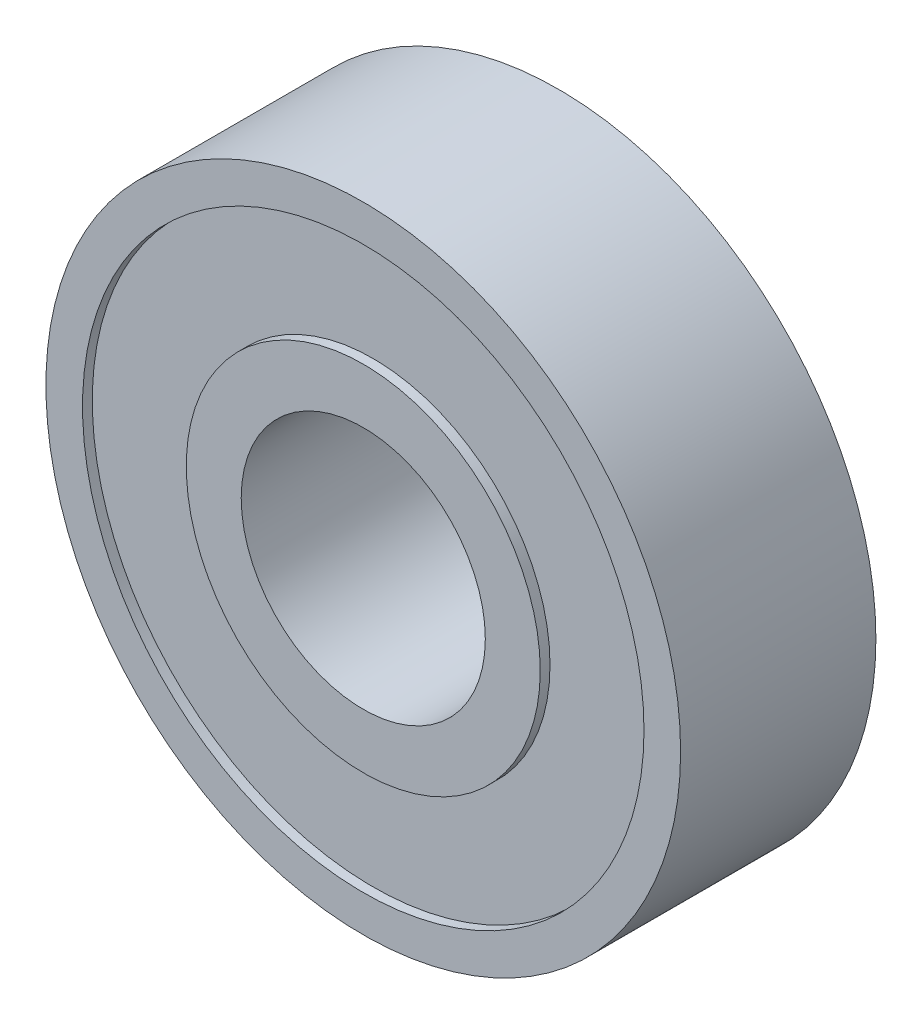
ISO-10303-21;
HEADER;
FILE_DESCRIPTION(('STEP AP214'),'2;1');
FILE_NAME('part.step','',(''),(''),'','','');
FILE_SCHEMA(('AUTOMOTIVE_DESIGN { 1 0 10303 214 1 1 1 1 }'));
ENDSEC;
DATA;
#1=APPLICATION_CONTEXT('core data for automotive mechanical design processes');
#2=APPLICATION_PROTOCOL_DEFINITION('international standard','automotive_design',2000,#1);
#3=PRODUCT_CONTEXT('',#1,'mechanical');
#4=PRODUCT('Part','Part','',(#3));
#5=PRODUCT_RELATED_PRODUCT_CATEGORY('part','',(#4));
#6=PRODUCT_DEFINITION_FORMATION('','',#4);
#7=PRODUCT_DEFINITION_CONTEXT('part definition',#1,'design');
#8=PRODUCT_DEFINITION('design','',#6,#7);
#9=PRODUCT_DEFINITION_SHAPE('','',#8);
#10=(LENGTH_UNIT() NAMED_UNIT(*) SI_UNIT(.MILLI.,.METRE.));
#11=(NAMED_UNIT(*) PLANE_ANGLE_UNIT() SI_UNIT($,.RADIAN.));
#12=(NAMED_UNIT(*) SI_UNIT($,.STERADIAN.) SOLID_ANGLE_UNIT());
#13=UNCERTAINTY_MEASURE_WITH_UNIT(LENGTH_MEASURE(1.E-05),#10,'distance_accuracy_value','');
#14=(GEOMETRIC_REPRESENTATION_CONTEXT(3) GLOBAL_UNCERTAINTY_ASSIGNED_CONTEXT((#13)) GLOBAL_UNIT_ASSIGNED_CONTEXT((#10,
#11,#12)) REPRESENTATION_CONTEXT('',''));
#15=CARTESIAN_POINT('',(0.,0.,0.));
#16=DIRECTION('',(0.,0.,1.));
#17=DIRECTION('',(1.,0.,0.));
#18=AXIS2_PLACEMENT_3D('',#15,#16,#17);
#19=CARTESIAN_POINT('',(0.,0.,-4.));
#20=DIRECTION('',(0.,0.,1.));
#21=DIRECTION('',(1.,0.,0.));
#22=AXIS2_PLACEMENT_3D('',#19,#20,#21);
#23=PLANE('',#22);
#24=CARTESIAN_POINT('',(0.,0.,-4.));
#25=DIRECTION('',(0.,0.,1.));
#26=DIRECTION('',(1.,0.,0.));
#27=AXIS2_PLACEMENT_3D('',#24,#25,#26);
#28=CIRCLE('',#27,13.);
#29=CARTESIAN_POINT('',(13.,0.,-4.));
#30=VERTEX_POINT('',#29);
#31=EDGE_CURVE('E34',#30,#30,#28,.T.);
#32=ORIENTED_EDGE('',*,*,#31,.F.);
#33=EDGE_LOOP('',(#32));
#34=FACE_BOUND('',#33,.T.);
#35=CARTESIAN_POINT('',(0.,0.,-4.));
#36=DIRECTION('',(0.,0.,1.));
#37=DIRECTION('',(1.,0.,0.));
#38=AXIS2_PLACEMENT_3D('',#35,#36,#37);
#39=CIRCLE('',#38,11.5);
#40=CARTESIAN_POINT('',(11.5,0.,-4.));
#41=VERTEX_POINT('',#40);
#42=EDGE_CURVE('E61',#41,#41,#39,.T.);
#43=ORIENTED_EDGE('',*,*,#42,.T.);
#44=EDGE_LOOP('',(#43));
#45=FACE_BOUND('',#44,.T.);
#46=ADVANCED_FACE('F30',(#34,#45),#23,.F.);
#47=CARTESIAN_POINT('',(0.,0.,4.));
#48=DIRECTION('',(0.,0.,1.));
#49=DIRECTION('',(1.,0.,0.));
#50=AXIS2_PLACEMENT_3D('',#47,#48,#49);
#51=PLANE('',#50);
#52=CARTESIAN_POINT('',(0.,0.,4.));
#53=DIRECTION('',(0.,0.,1.));
#54=DIRECTION('',(1.,0.,0.));
#55=AXIS2_PLACEMENT_3D('',#52,#53,#54);
#56=CIRCLE('',#55,5.);
#57=CARTESIAN_POINT('',(5.,0.,4.));
#58=VERTEX_POINT('',#57);
#59=EDGE_CURVE('E41',#58,#58,#56,.T.);
#60=ORIENTED_EDGE('',*,*,#59,.F.);
#61=EDGE_LOOP('',(#60));
#62=FACE_BOUND('',#61,.T.);
#63=CARTESIAN_POINT('',(0.,0.,4.));
#64=DIRECTION('',(0.,0.,1.));
#65=DIRECTION('',(1.,0.,0.));
#66=AXIS2_PLACEMENT_3D('',#63,#64,#65);
#67=CIRCLE('',#66,7.25);
#68=CARTESIAN_POINT('',(7.25,0.,4.));
#69=VERTEX_POINT('',#68);
#70=EDGE_CURVE('E55',#69,#69,#67,.T.);
#71=ORIENTED_EDGE('',*,*,#70,.T.);
#72=EDGE_LOOP('',(#71));
#73=FACE_BOUND('',#72,.T.);
#74=ADVANCED_FACE('F103',(#62,#73),#51,.T.);
#75=CARTESIAN_POINT('',(0.,0.,4.));
#76=DIRECTION('',(0.,0.,1.));
#77=DIRECTION('',(1.,0.,0.));
#78=AXIS2_PLACEMENT_3D('',#75,#76,#77);
#79=CIRCLE('',#78,11.5);
#80=CARTESIAN_POINT('',(11.5,0.,4.));
#81=VERTEX_POINT('',#80);
#82=EDGE_CURVE('E49',#81,#81,#79,.T.);
#83=ORIENTED_EDGE('',*,*,#82,.F.);
#84=EDGE_LOOP('',(#83));
#85=FACE_BOUND('',#84,.T.);
#86=CARTESIAN_POINT('',(0.,0.,4.));
#87=DIRECTION('',(0.,0.,1.));
#88=DIRECTION('',(1.,0.,0.));
#89=AXIS2_PLACEMENT_3D('',#86,#87,#88);
#90=CIRCLE('',#89,13.);
#91=CARTESIAN_POINT('',(13.,0.,4.));
#92=VERTEX_POINT('',#91);
#93=EDGE_CURVE('E10',#92,#92,#90,.T.);
#94=ORIENTED_EDGE('',*,*,#93,.T.);
#95=EDGE_LOOP('',(#94));
#96=FACE_BOUND('',#95,.T.);
#97=ADVANCED_FACE('F85',(#85,#96),#51,.T.);
#98=CARTESIAN_POINT('',(0.,0.,-4.));
#99=DIRECTION('',(0.,0.,1.));
#100=DIRECTION('',(1.,0.,0.));
#101=AXIS2_PLACEMENT_3D('',#98,#99,#100);
#102=CIRCLE('',#101,7.25);
#103=CARTESIAN_POINT('',(7.25,0.,-4.));
#104=VERTEX_POINT('',#103);
#105=EDGE_CURVE('E67',#104,#104,#102,.T.);
#106=ORIENTED_EDGE('',*,*,#105,.F.);
#107=EDGE_LOOP('',(#106));
#108=FACE_BOUND('',#107,.T.);
#109=CARTESIAN_POINT('',(0.,0.,-4.));
#110=DIRECTION('',(0.,0.,1.));
#111=DIRECTION('',(1.,0.,0.));
#112=AXIS2_PLACEMENT_3D('',#109,#110,#111);
#113=CIRCLE('',#112,5.);
#114=CARTESIAN_POINT('',(5.,0.,-4.));
#115=VERTEX_POINT('',#114);
#116=EDGE_CURVE('E43',#115,#115,#113,.T.);
#117=ORIENTED_EDGE('',*,*,#116,.T.);
#118=EDGE_LOOP('',(#117));
#119=FACE_BOUND('',#118,.T.);
#120=ADVANCED_FACE('F82',(#108,#119),#23,.F.);
#121=CARTESIAN_POINT('',(0.,0.,4.));
#122=DIRECTION('',(0.,0.,-1.));
#123=DIRECTION('',(-1.,0.,0.));
#124=AXIS2_PLACEMENT_3D('',#121,#122,#123);
#125=CYLINDRICAL_SURFACE('',#124,13.);
#126=ORIENTED_EDGE('',*,*,#93,.F.);
#127=EDGE_LOOP('',(#126));
#128=FACE_BOUND('',#127,.T.);
#129=ORIENTED_EDGE('',*,*,#31,.T.);
#130=EDGE_LOOP('',(#129));
#131=FACE_BOUND('',#130,.T.);
#132=ADVANCED_FACE('F32',(#128,#131),#125,.T.);
#133=CARTESIAN_POINT('',(0.,0.,4.));
#134=DIRECTION('',(0.,0.,-1.));
#135=DIRECTION('',(-1.,0.,0.));
#136=AXIS2_PLACEMENT_3D('',#133,#134,#135);
#137=CYLINDRICAL_SURFACE('',#136,5.);
#138=ORIENTED_EDGE('',*,*,#59,.T.);
#139=EDGE_LOOP('',(#138));
#140=FACE_BOUND('',#139,.T.);
#141=ORIENTED_EDGE('',*,*,#116,.F.);
#142=EDGE_LOOP('',(#141));
#143=FACE_BOUND('',#142,.T.);
#144=ADVANCED_FACE('F88',(#140,#143),#137,.F.);
#145=CARTESIAN_POINT('',(0.,0.,3.6));
#146=DIRECTION('',(0.,0.,1.));
#147=DIRECTION('',(1.,0.,0.));
#148=AXIS2_PLACEMENT_3D('',#145,#146,#147);
#149=CYLINDRICAL_SURFACE('',#148,11.5);
#150=CARTESIAN_POINT('',(0.,0.,3.6));
#151=DIRECTION('',(0.,0.,1.));
#152=DIRECTION('',(1.,0.,0.));
#153=AXIS2_PLACEMENT_3D('',#150,#151,#152);
#154=CIRCLE('',#153,11.5);
#155=CARTESIAN_POINT('',(11.5,0.,3.6));
#156=VERTEX_POINT('',#155);
#157=EDGE_CURVE('E46',#156,#156,#154,.T.);
#158=ORIENTED_EDGE('',*,*,#157,.F.);
#159=EDGE_LOOP('',(#158));
#160=FACE_BOUND('',#159,.T.);
#161=ORIENTED_EDGE('',*,*,#82,.T.);
#162=EDGE_LOOP('',(#161));
#163=FACE_BOUND('',#162,.T.);
#164=ADVANCED_FACE('F90',(#160,#163),#149,.F.);
#165=CARTESIAN_POINT('',(0.,0.,3.6));
#166=DIRECTION('',(0.,0.,1.));
#167=DIRECTION('',(1.,0.,0.));
#168=AXIS2_PLACEMENT_3D('',#165,#166,#167);
#169=PLANE('',#168);
#170=CARTESIAN_POINT('',(0.,0.,3.6));
#171=DIRECTION('',(0.,0.,1.));
#172=DIRECTION('',(1.,0.,0.));
#173=AXIS2_PLACEMENT_3D('',#170,#171,#172);
#174=CIRCLE('',#173,7.25);
#175=CARTESIAN_POINT('',(7.25,0.,3.6));
#176=VERTEX_POINT('',#175);
#177=EDGE_CURVE('E52',#176,#176,#174,.T.);
#178=ORIENTED_EDGE('',*,*,#177,.F.);
#179=EDGE_LOOP('',(#178));
#180=FACE_BOUND('',#179,.T.);
#181=ORIENTED_EDGE('',*,*,#157,.T.);
#182=EDGE_LOOP('',(#181));
#183=FACE_BOUND('',#182,.T.);
#184=ADVANCED_FACE('F97',(#180,#183),#169,.T.);
#185=CARTESIAN_POINT('',(0.,0.,3.6));
#186=DIRECTION('',(0.,0.,1.));
#187=DIRECTION('',(1.,0.,0.));
#188=AXIS2_PLACEMENT_3D('',#185,#186,#187);
#189=CYLINDRICAL_SURFACE('',#188,7.25);
#190=ORIENTED_EDGE('',*,*,#177,.T.);
#191=EDGE_LOOP('',(#190));
#192=FACE_BOUND('',#191,.T.);
#193=ORIENTED_EDGE('',*,*,#70,.F.);
#194=EDGE_LOOP('',(#193));
#195=FACE_BOUND('',#194,.T.);
#196=ADVANCED_FACE('F151',(#192,#195),#189,.T.);
#197=CARTESIAN_POINT('',(0.,0.,-3.6));
#198=DIRECTION('',(0.,0.,-1.));
#199=DIRECTION('',(1.,0.,0.));
#200=AXIS2_PLACEMENT_3D('',#197,#198,#199);
#201=PLANE('',#200);
#202=CARTESIAN_POINT('',(0.,0.,-3.6));
#203=DIRECTION('',(0.,0.,1.));
#204=DIRECTION('',(1.,0.,0.));
#205=AXIS2_PLACEMENT_3D('',#202,#203,#204);
#206=CIRCLE('',#205,11.5);
#207=CARTESIAN_POINT('',(11.5,0.,-3.6));
#208=VERTEX_POINT('',#207);
#209=EDGE_CURVE('E58',#208,#208,#206,.T.);
#210=ORIENTED_EDGE('',*,*,#209,.F.);
#211=EDGE_LOOP('',(#210));
#212=FACE_BOUND('',#211,.T.);
#213=CARTESIAN_POINT('',(0.,0.,-3.6));
#214=DIRECTION('',(0.,0.,1.));
#215=DIRECTION('',(1.,0.,0.));
#216=AXIS2_PLACEMENT_3D('',#213,#214,#215);
#217=CIRCLE('',#216,7.25);
#218=CARTESIAN_POINT('',(7.25,0.,-3.6));
#219=VERTEX_POINT('',#218);
#220=EDGE_CURVE('E64',#219,#219,#217,.T.);
#221=ORIENTED_EDGE('',*,*,#220,.T.);
#222=EDGE_LOOP('',(#221));
#223=FACE_BOUND('',#222,.T.);
#224=ADVANCED_FACE('F73',(#212,#223),#201,.T.);
#225=CARTESIAN_POINT('',(0.,0.,-3.6));
#226=DIRECTION('',(0.,0.,-1.));
#227=DIRECTION('',(-1.,0.,0.));
#228=AXIS2_PLACEMENT_3D('',#225,#226,#227);
#229=CYLINDRICAL_SURFACE('',#228,11.5);
#230=ORIENTED_EDGE('',*,*,#209,.T.);
#231=EDGE_LOOP('',(#230));
#232=FACE_BOUND('',#231,.T.);
#233=ORIENTED_EDGE('',*,*,#42,.F.);
#234=EDGE_LOOP('',(#233));
#235=FACE_BOUND('',#234,.T.);
#236=ADVANCED_FACE('F78',(#232,#235),#229,.F.);
#237=CARTESIAN_POINT('',(0.,0.,-3.6));
#238=DIRECTION('',(0.,0.,-1.));
#239=DIRECTION('',(-1.,0.,0.));
#240=AXIS2_PLACEMENT_3D('',#237,#238,#239);
#241=CYLINDRICAL_SURFACE('',#240,7.25);
#242=ORIENTED_EDGE('',*,*,#220,.F.);
#243=EDGE_LOOP('',(#242));
#244=FACE_BOUND('',#243,.T.);
#245=ORIENTED_EDGE('',*,*,#105,.T.);
#246=EDGE_LOOP('',(#245));
#247=FACE_BOUND('',#246,.T.);
#248=ADVANCED_FACE('F75',(#244,#247),#241,.T.);
#249=CLOSED_SHELL('',(#46,#74,#97,#120,#132,#144,#164,#184,#196,#224,#236,#248));
#250=MANIFOLD_SOLID_BREP('B2',#249);
#251=ADVANCED_BREP_SHAPE_REPRESENTATION('',(#18,#250),#14);
#252=SHAPE_DEFINITION_REPRESENTATION(#9,#251);
ENDSEC;
END-ISO-10303-21;
